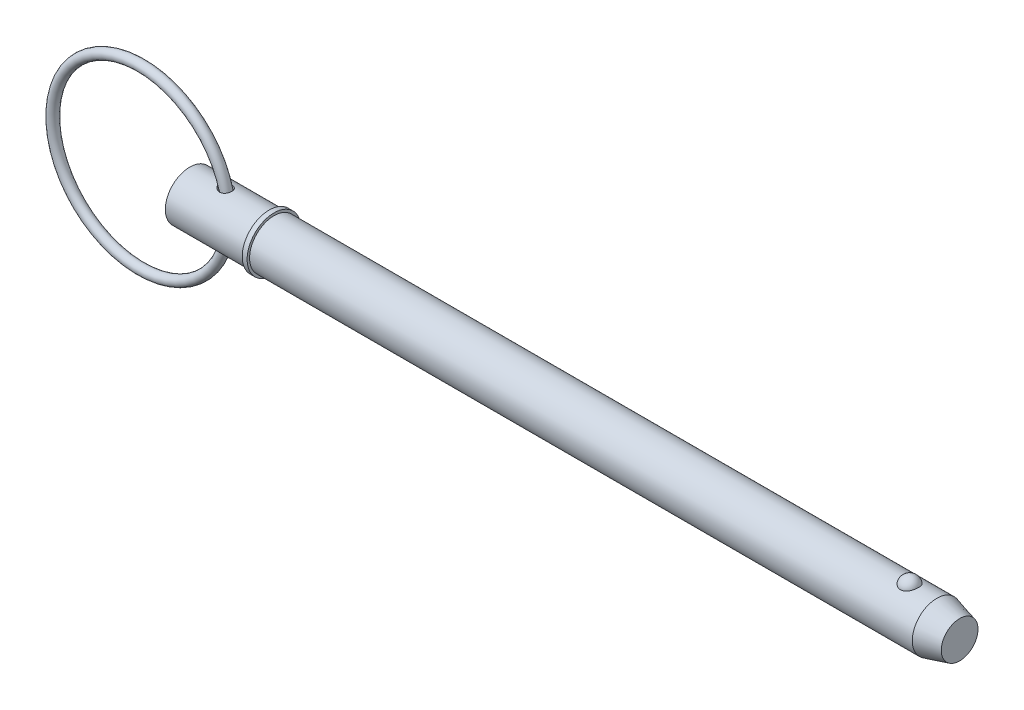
ISO-10303-21;
HEADER;
FILE_DESCRIPTION(('STEP AP214'),'2;1');
FILE_NAME('part.step','',(''),(''),'','','');
FILE_SCHEMA(('AUTOMOTIVE_DESIGN { 1 0 10303 214 1 1 1 1 }'));
ENDSEC;
DATA;
#1=APPLICATION_CONTEXT('core data for automotive mechanical design processes');
#2=APPLICATION_PROTOCOL_DEFINITION('international standard','automotive_design',2000,#1);
#3=PRODUCT_CONTEXT('',#1,'mechanical');
#4=PRODUCT('Part','Part','',(#3));
#5=PRODUCT_RELATED_PRODUCT_CATEGORY('part','',(#4));
#6=PRODUCT_DEFINITION_FORMATION('','',#4);
#7=PRODUCT_DEFINITION_CONTEXT('part definition',#1,'design');
#8=PRODUCT_DEFINITION('design','',#6,#7);
#9=PRODUCT_DEFINITION_SHAPE('','',#8);
#10=(LENGTH_UNIT() NAMED_UNIT(*) SI_UNIT(.MILLI.,.METRE.));
#11=(NAMED_UNIT(*) PLANE_ANGLE_UNIT() SI_UNIT($,.RADIAN.));
#12=(NAMED_UNIT(*) SI_UNIT($,.STERADIAN.) SOLID_ANGLE_UNIT());
#13=UNCERTAINTY_MEASURE_WITH_UNIT(LENGTH_MEASURE(1.E-05),#10,'distance_accuracy_value','');
#14=(GEOMETRIC_REPRESENTATION_CONTEXT(3) GLOBAL_UNCERTAINTY_ASSIGNED_CONTEXT((#13)) GLOBAL_UNIT_ASSIGNED_CONTEXT((#10,
#11,#12)) REPRESENTATION_CONTEXT('',''));
#15=CARTESIAN_POINT('',(0.,0.,0.));
#16=DIRECTION('',(0.,0.,1.));
#17=DIRECTION('',(1.,0.,0.));
#18=AXIS2_PLACEMENT_3D('',#15,#16,#17);
#19=CARTESIAN_POINT('',(-15.855506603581,0.,0.));
#20=DIRECTION('',(0.,0.,1.));
#21=DIRECTION('',(1.,0.,0.));
#22=AXIS2_PLACEMENT_3D('',#19,#20,#21);
#23=TOROIDAL_SURFACE('',#22,28.575,1.588);
#24=CARTESIAN_POINT('',(14.307493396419,0.,0.));
#25=VERTEX_POINT('',#24);
#26=VERTEX_LOOP('',#25);
#27=FACE_BOUND('',#26,.T.);
#28=ADVANCED_FACE('P0_F12',(#27),#23,.T.);
#29=CLOSED_SHELL('',(#28));
#30=MANIFOLD_SOLID_BREP('P0_B1',#29);
#31=CARTESIAN_POINT('',(0.,0.,0.));
#32=DIRECTION('',(1.,0.,0.));
#33=DIRECTION('',(0.,0.,-1.));
#34=AXIS2_PLACEMENT_3D('',#31,#32,#33);
#35=CYLINDRICAL_SURFACE('',#34,7.94);
#36=CARTESIAN_POINT('',(9.9064878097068,7.8609270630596,-1.11777712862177));
#37=CARTESIAN_POINT('',(9.98046148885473,7.84701054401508,-1.21564239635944));
#38=CARTESIAN_POINT('',(10.0632949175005,7.83217804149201,-1.30680329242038));
#39=CARTESIAN_POINT('',(10.243327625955,7.80247884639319,-1.47382688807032));
#40=CARTESIAN_POINT('',(10.3405572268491,7.78761214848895,-1.54965647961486));
#41=CARTESIAN_POINT('',(10.5460150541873,7.75960959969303,-1.6842723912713));
#42=CARTESIAN_POINT('',(10.654212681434,7.74646915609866,-1.74310445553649));
#43=CARTESIAN_POINT('',(10.8789333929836,7.72340979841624,-1.84259563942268));
#44=CARTESIAN_POINT('',(10.9954527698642,7.71348946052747,-1.88326279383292));
#45=CARTESIAN_POINT('',(11.2371543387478,7.69793327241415,-1.94589519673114));
#46=CARTESIAN_POINT('',(11.3624861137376,7.69242163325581,-1.96732022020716));
#47=CARTESIAN_POINT('',(11.6151110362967,7.68708151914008,-1.98809161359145));
#48=CARTESIAN_POINT('',(11.7424035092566,7.68725113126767,-1.98744541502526));
#49=CARTESIAN_POINT('',(11.9871377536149,7.69329740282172,-1.96389977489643));
#50=CARTESIAN_POINT('',(12.1047148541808,7.69883374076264,-1.94232728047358));
#51=CARTESIAN_POINT('',(12.3339179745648,7.7145667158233,-1.87886184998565));
#52=CARTESIAN_POINT('',(12.4455463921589,7.72476145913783,-1.83697717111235));
#53=CARTESIAN_POINT('',(12.6521036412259,7.74778151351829,-1.73721211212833));
#54=CARTESIAN_POINT('',(12.7476463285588,7.76039274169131,-1.68054854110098));
#55=CARTESIAN_POINT('',(12.9274536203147,7.78715828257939,-1.55179691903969));
#56=CARTESIAN_POINT('',(13.0117191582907,7.80131246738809,-1.47971014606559));
#57=CARTESIAN_POINT('',(13.16544092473,7.82932755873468,-1.32341211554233));
#58=CARTESIAN_POINT('',(13.2351086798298,7.84318958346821,-1.23940873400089));
#59=CARTESIAN_POINT('',(13.3595610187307,7.86933512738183,-1.06080152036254));
#60=CARTESIAN_POINT('',(13.4143450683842,7.88161858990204,-0.966197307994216));
#61=CARTESIAN_POINT('',(13.5082288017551,7.90340571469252,-0.767990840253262));
#62=CARTESIAN_POINT('',(13.5471601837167,7.91287927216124,-0.664305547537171));
#63=CARTESIAN_POINT('',(13.6076213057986,7.92785679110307,-0.451705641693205));
#64=CARTESIAN_POINT('',(13.6291504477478,7.93336061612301,-0.3427908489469));
#65=CARTESIAN_POINT('',(13.6544025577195,7.93983472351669,-0.122042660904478));
#66=CARTESIAN_POINT('',(13.6580055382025,7.94077445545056,-0.0101946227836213));
#67=CARTESIAN_POINT('',(13.6469977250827,7.93793630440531,0.212542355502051));
#68=CARTESIAN_POINT('',(13.6323866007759,7.93415833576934,0.323431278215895));
#69=CARTESIAN_POINT('',(13.5852649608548,7.92228583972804,0.541194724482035));
#70=CARTESIAN_POINT('',(13.5527398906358,7.91418780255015,0.648065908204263));
#71=CARTESIAN_POINT('',(13.4705326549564,7.8945509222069,0.854658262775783));
#72=CARTESIAN_POINT('',(13.4208502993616,7.88301204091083,0.954379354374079));
#73=CARTESIAN_POINT('',(13.3056021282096,7.85778224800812,1.14366619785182));
#74=CARTESIAN_POINT('',(13.2400609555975,7.8440946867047,1.23324739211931));
#75=CARTESIAN_POINT('',(13.0946981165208,7.8160855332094,1.39984119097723));
#76=CARTESIAN_POINT('',(13.0148777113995,7.80176399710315,1.47685490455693));
#77=CARTESIAN_POINT('',(12.8438529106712,7.774237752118,1.6154855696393));
#78=CARTESIAN_POINT('',(12.7527554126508,7.76102428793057,1.67723263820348));
#79=CARTESIAN_POINT('',(12.5611987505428,7.73705789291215,1.78453696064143));
#80=CARTESIAN_POINT('',(12.4607407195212,7.72630466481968,1.83009617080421));
#81=CARTESIAN_POINT('',(12.2541997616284,7.70849465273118,1.90371822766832));
#82=CARTESIAN_POINT('',(12.1481665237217,7.7014098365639,1.93191408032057));
#83=CARTESIAN_POINT('',(11.9327851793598,7.69148605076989,1.97105353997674));
#84=CARTESIAN_POINT('',(11.8234367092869,7.68864754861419,1.98199524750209));
#85=CARTESIAN_POINT('',(11.6016024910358,7.68735890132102,1.98698770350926));
#86=CARTESIAN_POINT('',(11.4891069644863,7.68902083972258,1.98060702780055));
#87=CARTESIAN_POINT('',(11.2665484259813,7.6966276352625,1.95083303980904));
#88=CARTESIAN_POINT('',(11.1564861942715,7.70257384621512,1.92743434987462));
#89=CARTESIAN_POINT('',(10.9339966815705,7.71853798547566,1.86251478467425));
#90=CARTESIAN_POINT('',(10.8219140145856,7.72880438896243,1.81987394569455));
#91=CARTESIAN_POINT('',(10.6060441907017,7.75216432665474,1.7176403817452));
#92=CARTESIAN_POINT('',(10.5022611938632,7.76525926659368,1.65803922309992));
#93=CARTESIAN_POINT('',(10.3000447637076,7.79362794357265,1.51929354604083));
#94=CARTESIAN_POINT('',(10.2022480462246,7.80898310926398,1.4392327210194));
#95=CARTESIAN_POINT('',(10.0221668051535,7.83939672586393,1.26310118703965));
#96=CARTESIAN_POINT('',(9.93988168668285,7.85445518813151,1.16703109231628));
#97=CARTESIAN_POINT('',(9.79729823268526,7.88178950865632,0.964874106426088));
#98=CARTESIAN_POINT('',(9.73627994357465,7.89414970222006,0.859310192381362));
#99=CARTESIAN_POINT('',(9.63554001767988,7.91508909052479,0.638143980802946));
#100=CARTESIAN_POINT('',(9.59578986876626,7.92367334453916,0.52255536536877));
#101=CARTESIAN_POINT('',(9.54388714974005,7.93499161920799,0.300466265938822));
#102=CARTESIAN_POINT('',(9.52888458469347,7.93832727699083,0.194660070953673));
#103=CARTESIAN_POINT('',(9.51823078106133,7.94068976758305,-0.0179747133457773));
#104=CARTESIAN_POINT('',(9.52257317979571,7.93971801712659,-0.124802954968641));
#105=CARTESIAN_POINT('',(9.54911264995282,7.93386114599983,-0.326814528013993));
#106=CARTESIAN_POINT('',(9.56976509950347,7.92931471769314,-0.422217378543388));
#107=CARTESIAN_POINT('',(9.62591284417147,7.91721462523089,-0.608271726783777));
#108=CARTESIAN_POINT('',(9.66139801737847,7.90966301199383,-0.698926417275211));
#109=CARTESIAN_POINT('',(9.7317197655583,7.89515389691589,-0.844763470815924));
#110=CARTESIAN_POINT('',(9.76292633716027,7.88881879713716,-0.90180107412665));
#111=CARTESIAN_POINT('',(9.83075962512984,7.87538342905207,-1.01244242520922));
#112=CARTESIAN_POINT('',(9.86738597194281,7.86828321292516,-1.06604640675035));
#113=CARTESIAN_POINT('',(9.9064878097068,7.8609270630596,-1.11777712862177));
#114=B_SPLINE_CURVE_WITH_KNOTS('',3,(#36,#37,#38,#39,#40,#41,#42,#43,#44,#45,#46,#47,#48,#49,
#50,#51,#52,#53,#54,#55,#56,#57,#58,#59,#60,#61,#62,#63,#64,#65,#66,#67,#68,#69,#70,#71,#72,#73,
#74,#75,#76,#77,#78,#79,#80,#81,#82,#83,#84,#85,#86,#87,#88,#89,#90,#91,#92,#93,#94,#95,#96,#97,
#98,#99,#100,#101,#102,#103,#104,#105,#106,#107,#108,#109,#110,#111,#112,#113),.UNSPECIFIED.,
.T.,.F.,(4,2,2,2,2,2,2,2,2,2,2,2,2,2,2,2,2,2,2,2,2,2,2,2,2,2,2,2,2,2,2,2,2,2,2,2,2,2,4),(0.,
0.370138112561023,0.741067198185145,1.11098852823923,1.48074607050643,1.86058657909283,
2.24029919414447,2.59740885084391,2.95437345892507,3.2881332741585,3.62186544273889,
3.95036374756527,4.27887384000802,4.61078596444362,4.94270949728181,5.27685177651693,
5.61100012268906,5.94542035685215,6.27984429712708,6.61375187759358,6.94762997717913,
7.27855592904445,7.60944187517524,7.93776058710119,8.26611544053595,8.60272268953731,
8.93943635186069,9.29895306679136,9.65864886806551,10.0387340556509,10.4188046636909,
10.7843533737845,11.1494107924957,11.4683925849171,11.7872694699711,12.0791172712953,
12.3707662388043,12.5664313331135,12.7620830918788),.UNSPECIFIED.);
#115=CARTESIAN_POINT('',(9.9064878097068,7.8609270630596,-1.11777712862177));
#116=VERTEX_POINT('',#115);
#117=EDGE_CURVE('P1_E42',#116,#116,#114,.T.);
#118=ORIENTED_EDGE('',*,*,#117,.T.);
#119=EDGE_LOOP('',(#118));
#120=FACE_BOUND('',#119,.T.);
#121=CARTESIAN_POINT('',(0.,0.,0.));
#122=DIRECTION('',(1.,0.,0.));
#123=DIRECTION('',(0.,0.,-1.));
#124=AXIS2_PLACEMENT_3D('',#121,#122,#123);
#125=CIRCLE('',#124,7.94);
#126=CARTESIAN_POINT('',(0.,0.,-7.94));
#127=VERTEX_POINT('',#126);
#128=EDGE_CURVE('P1_E9',#127,#127,#125,.T.);
#129=ORIENTED_EDGE('',*,*,#128,.T.);
#130=EDGE_LOOP('',(#129));
#131=FACE_BOUND('',#130,.T.);
#132=CARTESIAN_POINT('',(25.722,0.,0.));
#133=DIRECTION('',(1.,0.,0.));
#134=DIRECTION('',(0.,0.,-1.));
#135=AXIS2_PLACEMENT_3D('',#132,#133,#134);
#136=CIRCLE('',#135,7.94);
#137=CARTESIAN_POINT('',(25.722,0.,-7.94));
#138=VERTEX_POINT('',#137);
#139=EDGE_CURVE('P1_E25',#138,#138,#136,.T.);
#140=ORIENTED_EDGE('',*,*,#139,.F.);
#141=EDGE_LOOP('',(#140));
#142=FACE_BOUND('',#141,.T.);
#143=CARTESIAN_POINT('',(9.9064878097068,-7.8609270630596,-1.11777712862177));
#144=CARTESIAN_POINT('',(9.84378768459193,-7.87272256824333,-1.03482250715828));
#145=CARTESIAN_POINT('',(9.7874122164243,-7.88386682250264,-0.947002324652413));
#146=CARTESIAN_POINT('',(9.68947008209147,-7.90377389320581,-0.763202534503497));
#147=CARTESIAN_POINT('',(9.64789384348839,-7.91253824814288,-0.667228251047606));
#148=CARTESIAN_POINT('',(9.58141396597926,-7.92676779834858,-0.46889851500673));
#149=CARTESIAN_POINT('',(9.55658638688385,-7.93221793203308,-0.36651622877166));
#150=CARTESIAN_POINT('',(9.525398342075,-7.9390896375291,-0.158837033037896));
#151=CARTESIAN_POINT('',(9.51903196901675,-7.94051249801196,-0.0535410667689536));
#152=CARTESIAN_POINT('',(9.5249639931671,-7.93919670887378,0.149856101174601));
#153=CARTESIAN_POINT('',(9.53611757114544,-7.9367132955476,0.24799461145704));
#154=CARTESIAN_POINT('',(9.57435037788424,-7.92833496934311,0.44094918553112));
#155=CARTESIAN_POINT('',(9.60143086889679,-7.92243978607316,0.535764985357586));
#156=CARTESIAN_POINT('',(9.67027872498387,-7.90782830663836,0.720026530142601));
#157=CARTESIAN_POINT('',(9.71210005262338,-7.89910165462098,0.809451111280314));
#158=CARTESIAN_POINT('',(9.80864905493,-7.87966534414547,0.980775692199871));
#159=CARTESIAN_POINT('',(9.86338092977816,-7.86895504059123,1.06267323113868));
#160=CARTESIAN_POINT('',(9.99009906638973,-7.84531573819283,1.22559225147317));
#161=CARTESIAN_POINT('',(10.0632770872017,-7.8322718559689,1.30566871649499));
#162=CARTESIAN_POINT('',(10.2208237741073,-7.80611237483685,1.45392159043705));
#163=CARTESIAN_POINT('',(10.3051986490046,-7.79299674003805,1.52209134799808));
#164=CARTESIAN_POINT('',(10.4935539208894,-7.76638841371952,1.65280871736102));
#165=CARTESIAN_POINT('',(10.5986730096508,-7.75303312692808,1.71374951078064));
#166=CARTESIAN_POINT('',(10.8175805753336,-7.72920597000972,1.81820073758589));
#167=CARTESIAN_POINT('',(10.9313721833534,-7.71873514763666,1.86170483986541));
#168=CARTESIAN_POINT('',(11.1696833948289,-7.70161777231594,1.93133079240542));
#169=CARTESIAN_POINT('',(11.2944525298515,-7.69514907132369,1.95665138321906));
#170=CARTESIAN_POINT('',(11.5466607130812,-7.6877908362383,1.98537345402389));
#171=CARTESIAN_POINT('',(11.6740986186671,-7.68689896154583,1.98878412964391));
#172=CARTESIAN_POINT('',(11.9206005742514,-7.690938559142,1.97309854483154));
#173=CARTESIAN_POINT('',(12.0397453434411,-7.69555832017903,1.95520713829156));
#174=CARTESIAN_POINT('',(12.2727177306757,-7.70968728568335,1.89872693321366));
#175=CARTESIAN_POINT('',(12.3865475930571,-7.71919440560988,1.86014695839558));
#176=CARTESIAN_POINT('',(12.5975118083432,-7.74115679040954,1.76641559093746));
#177=CARTESIAN_POINT('',(12.6952552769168,-7.75336701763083,1.71257254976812));
#178=CARTESIAN_POINT('',(12.8798510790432,-7.77962828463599,1.58901145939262));
#179=CARTESIAN_POINT('',(12.9667044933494,-7.79367914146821,1.51929498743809));
#180=CARTESIAN_POINT('',(13.1254818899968,-7.82172079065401,1.36751778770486));
#181=CARTESIAN_POINT('',(13.1976693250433,-7.83570718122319,1.28573131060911));
#182=CARTESIAN_POINT('',(13.3274495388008,-7.86236718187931,1.11111271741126));
#183=CARTESIAN_POINT('',(13.3850418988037,-7.87504075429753,1.01828028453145));
#184=CARTESIAN_POINT('',(13.4847470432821,-7.89782512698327,0.823214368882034));
#185=CARTESIAN_POINT('',(13.5267056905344,-7.90791011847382,0.72089908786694));
#186=CARTESIAN_POINT('',(13.5933891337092,-7.92427335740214,0.510509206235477));
#187=CARTESIAN_POINT('',(13.6181132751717,-7.9305514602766,0.40243438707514));
#188=CARTESIAN_POINT('',(13.6498843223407,-7.93866355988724,0.182728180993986));
#189=CARTESIAN_POINT('',(13.6567982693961,-7.94046412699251,0.0710763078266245));
#190=CARTESIAN_POINT('',(13.6524060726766,-7.93933046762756,-0.151845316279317));
#191=CARTESIAN_POINT('',(13.6410996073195,-7.93639615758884,-0.263115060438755));
#192=CARTESIAN_POINT('',(13.6005023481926,-7.92610202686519,-0.482238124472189));
#193=CARTESIAN_POINT('',(13.571192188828,-7.91873744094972,-0.590087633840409));
#194=CARTESIAN_POINT('',(13.495246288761,-7.90037565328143,-0.799178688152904));
#195=CARTESIAN_POINT('',(13.4486102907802,-7.88937839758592,-0.900420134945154));
#196=CARTESIAN_POINT('',(13.3391817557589,-7.86497175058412,-1.09328280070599));
#197=CARTESIAN_POINT('',(13.2764083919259,-7.85156522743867,-1.18491525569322));
#198=CARTESIAN_POINT('',(13.1362355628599,-7.8238261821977,-1.35604994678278));
#199=CARTESIAN_POINT('',(13.0588372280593,-7.80949373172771,-1.43555311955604));
#200=CARTESIAN_POINT('',(12.8921392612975,-7.78164292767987,-1.57955181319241));
#201=CARTESIAN_POINT('',(12.8029410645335,-7.76811892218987,-1.64416363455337));
#202=CARTESIAN_POINT('',(12.6146622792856,-7.74328422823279,-1.75742016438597));
#203=CARTESIAN_POINT('',(12.5155829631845,-7.73197325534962,-1.80606692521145));
#204=CARTESIAN_POINT('',(12.31135301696,-7.71289290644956,-1.88588502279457));
#205=CARTESIAN_POINT('',(12.2062651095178,-7.70509254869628,-1.91720981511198));
#206=CARTESIAN_POINT('',(11.9922253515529,-7.69365188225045,-1.96261878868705));
#207=CARTESIAN_POINT('',(11.8832731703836,-7.69001193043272,-1.97670149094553));
#208=CARTESIAN_POINT('',(11.662174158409,-7.6871142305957,-1.98794112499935));
#209=CARTESIAN_POINT('',(11.5500082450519,-7.6879499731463,-1.98473694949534));
#210=CARTESIAN_POINT('',(11.3276038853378,-7.69396349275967,-1.96129119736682));
#211=CARTESIAN_POINT('',(11.2173659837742,-7.6991424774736,-1.94104488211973));
#212=CARTESIAN_POINT('',(10.9943151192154,-7.71363470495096,-1.8826578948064));
#213=CARTESIAN_POINT('',(10.8818004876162,-7.72319478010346,-1.8434396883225));
#214=CARTESIAN_POINT('',(10.6644693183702,-7.74534199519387,-1.74804607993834));
#215=CARTESIAN_POINT('',(10.5596578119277,-7.75793109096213,-1.69185971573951));
#216=CARTESIAN_POINT('',(10.3538333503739,-7.78563853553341,-1.55958016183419));
#217=CARTESIAN_POINT('',(10.2535123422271,-7.80086820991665,-1.48242881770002));
#218=CARTESIAN_POINT('',(10.0678634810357,-7.83136022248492,-1.31182139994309));
#219=CARTESIAN_POINT('',(9.98252491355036,-7.84662252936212,-1.21837707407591));
#220=CARTESIAN_POINT('',(9.9064878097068,-7.8609270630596,-1.11777712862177));
#221=B_SPLINE_CURVE_WITH_KNOTS('',3,(#143,#144,#145,#146,#147,#148,#149,#150,#151,#152,#153,
#154,#155,#156,#157,#158,#159,#160,#161,#162,#163,#164,#165,#166,#167,#168,#169,#170,#171,#172,
#173,#174,#175,#176,#177,#178,#179,#180,#181,#182,#183,#184,#185,#186,#187,#188,#189,#190,#191,
#192,#193,#194,#195,#196,#197,#198,#199,#200,#201,#202,#203,#204,#205,#206,#207,#208,#209,#210,
#211,#212,#213,#214,#215,#216,#217,#218,#219,#220),.UNSPECIFIED.,.T.,.F.,(4,2,2,2,2,2,2,2,2,2,2,
2,2,2,2,2,2,2,2,2,2,2,2,2,2,2,2,2,2,2,2,2,2,2,2,2,2,2,4),(0.,0.313593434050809,
0.626983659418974,0.941787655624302,1.25649090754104,1.55146990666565,1.84647228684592,
2.14256601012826,2.43875619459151,2.76521830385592,3.09186220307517,3.45696288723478,
3.82219601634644,4.20267276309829,4.58298981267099,4.94277962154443,5.30241610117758,
5.63754619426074,5.9726430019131,6.30104941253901,6.62946524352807,6.96103833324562,
7.29262401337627,7.62667800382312,7.96073789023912,8.29515773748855,8.62958255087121,
8.96361184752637,9.29761533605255,9.62891449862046,9.96017105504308,10.288443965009,
10.616745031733,10.951930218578,11.2872086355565,11.6442788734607,12.0015802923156,
12.3821516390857,12.762449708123),.UNSPECIFIED.);
#222=CARTESIAN_POINT('',(9.9064878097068,-7.8609270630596,-1.11777712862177));
#223=VERTEX_POINT('',#222);
#224=EDGE_CURVE('P1_E17',#223,#223,#221,.T.);
#225=ORIENTED_EDGE('',*,*,#224,.T.);
#226=EDGE_LOOP('',(#225));
#227=FACE_BOUND('',#226,.T.);
#228=ADVANCED_FACE('P1_F13',(#120,#131,#142,#227),#35,.T.);
#229=CARTESIAN_POINT('',(0.,0.,0.));
#230=DIRECTION('',(1.,0.,0.));
#231=DIRECTION('',(0.,0.,-1.));
#232=AXIS2_PLACEMENT_3D('',#229,#230,#231);
#233=CYLINDRICAL_SURFACE('',#232,7.94);
#234=CARTESIAN_POINT('',(242.151879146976,0.,0.));
#235=DIRECTION('',(1.,0.,0.));
#236=DIRECTION('',(0.,0.,-1.));
#237=AXIS2_PLACEMENT_3D('',#234,#235,#236);
#238=CIRCLE('',#237,7.94);
#239=CARTESIAN_POINT('',(242.151879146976,0.,-7.94));
#240=VERTEX_POINT('',#239);
#241=EDGE_CURVE('P1_E99',#240,#240,#238,.T.);
#242=ORIENTED_EDGE('',*,*,#241,.F.);
#243=EDGE_LOOP('',(#242));
#244=FACE_BOUND('',#243,.T.);
#245=CARTESIAN_POINT('',(27.31,0.,0.));
#246=DIRECTION('',(1.,0.,0.));
#247=DIRECTION('',(0.,0.,-1.));
#248=AXIS2_PLACEMENT_3D('',#245,#246,#247);
#249=CIRCLE('',#248,7.94);
#250=CARTESIAN_POINT('',(27.31,0.,-7.94));
#251=VERTEX_POINT('',#250);
#252=EDGE_CURVE('P1_E96',#251,#251,#249,.T.);
#253=ORIENTED_EDGE('',*,*,#252,.T.);
#254=EDGE_LOOP('',(#253));
#255=FACE_BOUND('',#254,.T.);
#256=CARTESIAN_POINT('',(233.344907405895,7.37767842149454,2.93486986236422));
#257=CARTESIAN_POINT('',(233.192749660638,7.3776732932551,2.93487505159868));
#258=CARTESIAN_POINT('',(233.040632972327,7.38258419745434,2.92262454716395));
#259=CARTESIAN_POINT('',(232.740928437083,7.40163229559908,2.87404196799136));
#260=CARTESIAN_POINT('',(232.593339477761,7.41576720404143,2.83771585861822));
#261=CARTESIAN_POINT('',(232.307018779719,7.45161576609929,2.74218769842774));
#262=CARTESIAN_POINT('',(232.168274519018,7.47331841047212,2.68301886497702));
#263=CARTESIAN_POINT('',(231.902882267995,7.52194082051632,2.54350967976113));
#264=CARTESIAN_POINT('',(231.776236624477,7.54886159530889,2.46316523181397));
#265=CARTESIAN_POINT('',(231.534534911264,7.60594671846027,2.28090375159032));
#266=CARTESIAN_POINT('',(231.419906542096,7.63618114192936,2.1784421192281));
#267=CARTESIAN_POINT('',(231.208878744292,7.69614046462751,1.95608495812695));
#268=CARTESIAN_POINT('',(231.112482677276,7.72586526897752,1.83618622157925));
#269=CARTESIAN_POINT('',(230.935938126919,7.78314821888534,1.57628086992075));
#270=CARTESIAN_POINT('',(230.856707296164,7.81055035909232,1.43561546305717));
#271=CARTESIAN_POINT('',(230.721797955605,7.85879631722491,1.142363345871));
#272=CARTESIAN_POINT('',(230.666121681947,7.87963951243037,0.989775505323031));
#273=CARTESIAN_POINT('',(230.57881215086,7.91289645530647,0.674619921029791));
#274=CARTESIAN_POINT('',(230.54753090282,7.92518652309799,0.511941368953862));
#275=CARTESIAN_POINT('',(230.510975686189,7.93958930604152,0.183247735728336));
#276=CARTESIAN_POINT('',(230.505701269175,7.94170219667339,0.0172327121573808));
#277=CARTESIAN_POINT('',(230.521231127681,7.93554931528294,-0.312672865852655));
#278=CARTESIAN_POINT('',(230.541925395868,7.92732732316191,-0.476569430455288));
#279=CARTESIAN_POINT('',(230.60878655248,7.90141534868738,-0.798305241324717));
#280=CARTESIAN_POINT('',(230.654953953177,7.88372517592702,-0.956144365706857));
#281=CARTESIAN_POINT('',(230.771898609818,7.84066230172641,-1.26152073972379));
#282=CARTESIAN_POINT('',(230.842704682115,7.81528060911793,-1.40904568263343));
#283=CARTESIAN_POINT('',(231.007478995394,7.75948672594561,-1.68950598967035));
#284=CARTESIAN_POINT('',(231.101448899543,7.72907417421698,-1.82244030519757));
#285=CARTESIAN_POINT('',(231.310839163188,7.66640424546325,-2.07032792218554));
#286=CARTESIAN_POINT('',(231.426315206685,7.63414223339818,-2.18523308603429));
#287=CARTESIAN_POINT('',(231.6759006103,7.57149681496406,-2.39329737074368));
#288=CARTESIAN_POINT('',(231.810008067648,7.54111321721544,-2.48645870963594));
#289=CARTESIAN_POINT('',(232.090111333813,7.48650742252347,-2.64628132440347));
#290=CARTESIAN_POINT('',(232.235760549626,7.46215900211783,-2.71350554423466));
#291=CARTESIAN_POINT('',(232.537425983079,7.42171253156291,-2.82226614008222));
#292=CARTESIAN_POINT('',(232.693438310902,7.40561140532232,-2.86381209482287));
#293=CARTESIAN_POINT('',(233.002970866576,7.3842679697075,-2.9183907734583));
#294=CARTESIAN_POINT('',(233.156222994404,7.37852109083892,-2.93275024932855));
#295=CARTESIAN_POINT('',(233.463070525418,7.37700973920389,-2.93655208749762));
#296=CARTESIAN_POINT('',(233.616665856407,7.38124333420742,-2.92599927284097));
#297=CARTESIAN_POINT('',(233.914990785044,7.39890635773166,-2.88102897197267));
#298=CARTESIAN_POINT('',(234.059848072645,7.41205491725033,-2.84733999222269));
#299=CARTESIAN_POINT('',(234.34164329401,7.445801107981,-2.75788206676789));
#300=CARTESIAN_POINT('',(234.478580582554,7.46639934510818,-2.70211132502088));
#301=CARTESIAN_POINT('',(234.744061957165,7.51339098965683,-2.56858908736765));
#302=CARTESIAN_POINT('',(234.872354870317,7.53990200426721,-2.4903806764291));
#303=CARTESIAN_POINT('',(235.114244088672,7.59569503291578,-2.31462737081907));
#304=CARTESIAN_POINT('',(235.227837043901,7.6249776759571,-2.21707808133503));
#305=CARTESIAN_POINT('',(235.44322156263,7.68489473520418,-1.99982049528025));
#306=CARTESIAN_POINT('',(235.544148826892,7.71552419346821,-1.87925337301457));
#307=CARTESIAN_POINT('',(235.725186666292,7.77353016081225,-1.6226882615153));
#308=CARTESIAN_POINT('',(235.805293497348,7.80090608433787,-1.48668750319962));
#309=CARTESIAN_POINT('',(235.945361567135,7.85047992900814,-1.1981841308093));
#310=CARTESIAN_POINT('',(236.004587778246,7.8724818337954,-1.04529016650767));
#311=CARTESIAN_POINT('',(236.097982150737,7.90785114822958,-0.731080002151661));
#312=CARTESIAN_POINT('',(236.132149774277,7.92121837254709,-0.569763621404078));
#313=CARTESIAN_POINT('',(236.174795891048,7.93797834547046,-0.242812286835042));
#314=CARTESIAN_POINT('',(236.183204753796,7.94134405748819,-0.0771668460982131));
#315=CARTESIAN_POINT('',(236.173962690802,7.93767937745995,0.253276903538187));
#316=CARTESIAN_POINT('',(236.156312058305,7.93064910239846,0.418075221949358));
#317=CARTESIAN_POINT('',(236.095424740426,7.90695571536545,0.741525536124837));
#318=CARTESIAN_POINT('',(236.052281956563,7.8903279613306,0.900197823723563));
#319=CARTESIAN_POINT('',(235.94135358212,7.84916386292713,1.20759654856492));
#320=CARTESIAN_POINT('',(235.87356656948,7.82462706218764,1.35632241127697));
#321=CARTESIAN_POINT('',(235.714371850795,7.7700669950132,1.64032869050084));
#322=CARTESIAN_POINT('',(235.622861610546,7.74002008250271,1.7755471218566));
#323=CARTESIAN_POINT('',(235.418296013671,7.67774175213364,2.0280064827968));
#324=CARTESIAN_POINT('',(235.305241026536,7.64551037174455,2.14524772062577));
#325=CARTESIAN_POINT('',(235.060831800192,7.58265895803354,2.35778002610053));
#326=CARTESIAN_POINT('',(234.929583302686,7.5520309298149,2.45319004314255));
#327=CARTESIAN_POINT('',(234.651601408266,7.49579792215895,2.61999897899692));
#328=CARTESIAN_POINT('',(234.504867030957,7.4701932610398,2.69139637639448));
#329=CARTESIAN_POINT('',(234.192947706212,7.42622216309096,2.8105324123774));
#330=CARTESIAN_POINT('',(234.027220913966,7.40825002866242,2.85700910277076));
#331=CARTESIAN_POINT('',(233.689279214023,7.38398348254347,2.9191685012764));
#332=CARTESIAN_POINT('',(233.51706702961,7.3776842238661,2.93486399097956));
#333=CARTESIAN_POINT('',(233.344907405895,7.37767842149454,2.93486986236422));
#334=B_SPLINE_CURVE_WITH_KNOTS('',3,(#256,#257,#258,#259,#260,#261,#262,#263,#264,#265,#266,
#267,#268,#269,#270,#271,#272,#273,#274,#275,#276,#277,#278,#279,#280,#281,#282,#283,#284,#285,
#286,#287,#288,#289,#290,#291,#292,#293,#294,#295,#296,#297,#298,#299,#300,#301,#302,#303,#304,
#305,#306,#307,#308,#309,#310,#311,#312,#313,#314,#315,#316,#317,#318,#319,#320,#321,#322,#323,
#324,#325,#326,#327,#328,#329,#330,#331,#332,#333),.UNSPECIFIED.,.T.,.F.,(4,2,2,2,2,2,2,2,2,2,2,
2,2,2,2,2,2,2,2,2,2,2,2,2,2,2,2,2,2,2,2,2,2,2,2,2,2,2,4),(0.,0.455841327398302,
0.911569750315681,1.36663794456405,1.82179423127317,2.2897898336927,2.75787163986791,
3.24685368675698,3.73588214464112,4.23184282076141,4.72779494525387,5.22165321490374,
5.71552141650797,6.20996917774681,6.70445245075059,7.20023431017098,7.6959655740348,
8.18023418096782,8.66432203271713,9.1241069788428,9.58380291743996,10.0296503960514,
10.4755341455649,10.9312349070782,11.3870393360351,11.8654416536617,12.3439299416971,
12.8378875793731,13.3318558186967,13.8271581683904,14.3224549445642,14.8159385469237,
15.3094506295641,15.8051323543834,16.3008055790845,16.7937101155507,17.2866458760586,
17.8026240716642,18.3183879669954),.UNSPECIFIED.);
#335=CARTESIAN_POINT('',(233.344907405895,7.37767842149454,2.93486986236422));
#336=VERTEX_POINT('',#335);
#337=EDGE_CURVE('P1_E34',#336,#336,#334,.T.);
#338=ORIENTED_EDGE('',*,*,#337,.T.);
#339=EDGE_LOOP('',(#338));
#340=FACE_BOUND('',#339,.T.);
#341=ADVANCED_FACE('P1_F46',(#244,#255,#340),#233,.T.);
#342=CARTESIAN_POINT('',(0.,0.,0.));
#343=DIRECTION('',(-1.,0.,0.));
#344=DIRECTION('',(0.,0.,1.));
#345=AXIS2_PLACEMENT_3D('',#342,#343,#344);
#346=PLANE('',#345);
#347=ORIENTED_EDGE('',*,*,#128,.F.);
#348=EDGE_LOOP('',(#347));
#349=FACE_BOUND('',#348,.T.);
#350=ADVANCED_FACE('P1_F15',(#349),#346,.T.);
#351=CARTESIAN_POINT('',(25.722,7.94,0.));
#352=DIRECTION('',(-1.,0.,0.));
#353=DIRECTION('',(0.,0.,1.));
#354=AXIS2_PLACEMENT_3D('',#351,#352,#353);
#355=PLANE('',#354);
#356=ORIENTED_EDGE('',*,*,#139,.T.);
#357=EDGE_LOOP('',(#356));
#358=FACE_BOUND('',#357,.T.);
#359=CARTESIAN_POINT('',(25.722,0.,0.));
#360=DIRECTION('',(1.,0.,0.));
#361=DIRECTION('',(0.,0.,-1.));
#362=AXIS2_PLACEMENT_3D('',#359,#360,#361);
#363=CIRCLE('',#362,8.734);
#364=CARTESIAN_POINT('',(25.722,0.,-8.734));
#365=VERTEX_POINT('',#364);
#366=EDGE_CURVE('P1_E30',#365,#365,#363,.T.);
#367=ORIENTED_EDGE('',*,*,#366,.F.);
#368=EDGE_LOOP('',(#367));
#369=FACE_BOUND('',#368,.T.);
#370=ADVANCED_FACE('P1_F81',(#358,#369),#355,.T.);
#371=CARTESIAN_POINT('',(0.,0.,0.));
#372=DIRECTION('',(1.,0.,0.));
#373=DIRECTION('',(0.,0.,-1.));
#374=AXIS2_PLACEMENT_3D('',#371,#372,#373);
#375=CYLINDRICAL_SURFACE('',#374,8.734);
#376=ORIENTED_EDGE('',*,*,#366,.T.);
#377=EDGE_LOOP('',(#376));
#378=FACE_BOUND('',#377,.T.);
#379=CARTESIAN_POINT('',(27.31,0.,0.));
#380=DIRECTION('',(1.,0.,0.));
#381=DIRECTION('',(0.,0.,-1.));
#382=AXIS2_PLACEMENT_3D('',#379,#380,#381);
#383=CIRCLE('',#382,8.734);
#384=CARTESIAN_POINT('',(27.31,0.,-8.734));
#385=VERTEX_POINT('',#384);
#386=EDGE_CURVE('P1_E95',#385,#385,#383,.T.);
#387=ORIENTED_EDGE('',*,*,#386,.F.);
#388=EDGE_LOOP('',(#387));
#389=FACE_BOUND('',#388,.T.);
#390=ADVANCED_FACE('P1_F68',(#378,#389),#375,.T.);
#391=CARTESIAN_POINT('',(27.31,8.734,0.));
#392=DIRECTION('',(1.,0.,0.));
#393=DIRECTION('',(0.,0.,-1.));
#394=AXIS2_PLACEMENT_3D('',#391,#392,#393);
#395=PLANE('',#394);
#396=ORIENTED_EDGE('',*,*,#386,.T.);
#397=EDGE_LOOP('',(#396));
#398=FACE_BOUND('',#397,.T.);
#399=ORIENTED_EDGE('',*,*,#252,.F.);
#400=EDGE_LOOP('',(#399));
#401=FACE_BOUND('',#400,.T.);
#402=ADVANCED_FACE('P1_F62',(#398,#401),#395,.T.);
#403=CARTESIAN_POINT('',(249.56,0.,0.));
#404=DIRECTION('',(-1.,0.,0.));
#405=DIRECTION('',(0.,0.,1.));
#406=AXIS2_PLACEMENT_3D('',#403,#404,#405);
#407=CONICAL_SURFACE('',#406,5.95500000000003,0.261799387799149);
#408=ORIENTED_EDGE('',*,*,#241,.T.);
#409=EDGE_LOOP('',(#408));
#410=FACE_BOUND('',#409,.T.);
#411=CARTESIAN_POINT('',(249.56,0.,0.));
#412=DIRECTION('',(1.,0.,0.));
#413=DIRECTION('',(0.,0.,-1.));
#414=AXIS2_PLACEMENT_3D('',#411,#412,#413);
#415=CIRCLE('',#414,5.95500000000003);
#416=CARTESIAN_POINT('',(249.56,0.,-5.95500000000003));
#417=VERTEX_POINT('',#416);
#418=EDGE_CURVE('P1_E41',#417,#417,#415,.T.);
#419=ORIENTED_EDGE('',*,*,#418,.F.);
#420=EDGE_LOOP('',(#419));
#421=FACE_BOUND('',#420,.T.);
#422=ADVANCED_FACE('P1_F59',(#410,#421),#407,.T.);
#423=CARTESIAN_POINT('',(249.56,5.95500000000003,0.));
#424=DIRECTION('',(1.,0.,0.));
#425=DIRECTION('',(0.,0.,-1.));
#426=AXIS2_PLACEMENT_3D('',#423,#424,#425);
#427=PLANE('',#426);
#428=ORIENTED_EDGE('',*,*,#418,.T.);
#429=EDGE_LOOP('',(#428));
#430=FACE_BOUND('',#429,.T.);
#431=ADVANCED_FACE('P1_F55',(#430),#427,.T.);
#432=CARTESIAN_POINT('',(233.344907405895,7.14599999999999,0.));
#433=DIRECTION('',(-1.,0.,0.));
#434=DIRECTION('',(0.,-1.,0.));
#435=AXIS2_PLACEMENT_3D('',#432,#433,#434);
#436=SPHERICAL_SURFACE('',#435,2.944);
#437=ORIENTED_EDGE('',*,*,#337,.F.);
#438=EDGE_LOOP('',(#437));
#439=FACE_BOUND('',#438,.T.);
#440=ADVANCED_FACE('P1_F50',(#439),#436,.T.);
#441=CARTESIAN_POINT('',(-15.855506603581,0.,0.));
#442=DIRECTION('',(0.,0.,1.));
#443=DIRECTION('',(1.,0.,0.));
#444=AXIS2_PLACEMENT_3D('',#441,#442,#443);
#445=TOROIDAL_SURFACE('',#444,28.575,1.985);
#446=ORIENTED_EDGE('',*,*,#224,.F.);
#447=EDGE_LOOP('',(#446));
#448=FACE_BOUND('',#447,.T.);
#449=ORIENTED_EDGE('',*,*,#117,.F.);
#450=EDGE_LOOP('',(#449));
#451=FACE_BOUND('',#450,.T.);
#452=ADVANCED_FACE('P1_F54',(#448,#451),#445,.F.);
#453=CLOSED_SHELL('',(#228,#341,#350,#370,#390,#402,#422,#431,#440,#452));
#454=MANIFOLD_SOLID_BREP('P1_B1',#453);
#455=ADVANCED_BREP_SHAPE_REPRESENTATION('',(#18,#30,#454),#14);
#456=SHAPE_DEFINITION_REPRESENTATION(#9,#455);
ENDSEC;
END-ISO-10303-21;
